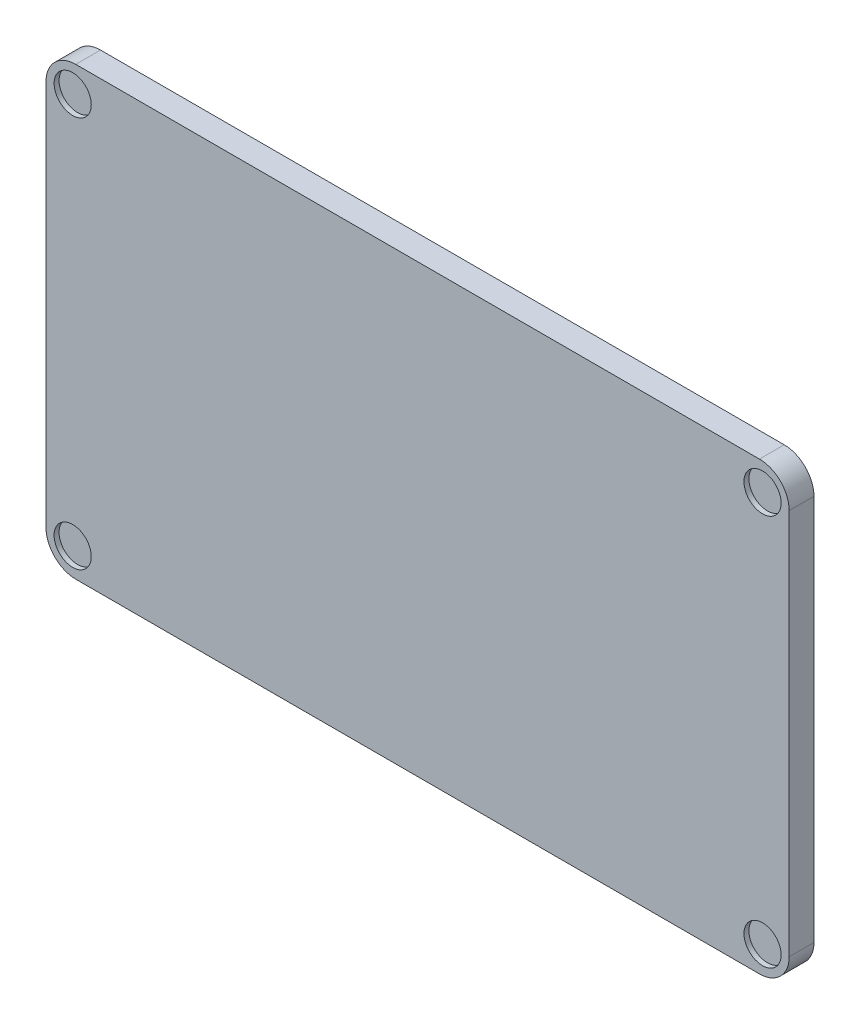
ISO-10303-21;
HEADER;
FILE_DESCRIPTION(('STEP AP214'),'2;1');
FILE_NAME('part.step','',(''),(''),'','','');
FILE_SCHEMA(('AUTOMOTIVE_DESIGN { 1 0 10303 214 1 1 1 1 }'));
ENDSEC;
DATA;
#1=APPLICATION_CONTEXT('core data for automotive mechanical design processes');
#2=APPLICATION_PROTOCOL_DEFINITION('international standard','automotive_design',2000,#1);
#3=PRODUCT_CONTEXT('',#1,'mechanical');
#4=PRODUCT('Part','Part','',(#3));
#5=PRODUCT_RELATED_PRODUCT_CATEGORY('part','',(#4));
#6=PRODUCT_DEFINITION_FORMATION('','',#4);
#7=PRODUCT_DEFINITION_CONTEXT('part definition',#1,'design');
#8=PRODUCT_DEFINITION('design','',#6,#7);
#9=PRODUCT_DEFINITION_SHAPE('','',#8);
#10=(LENGTH_UNIT() NAMED_UNIT(*) SI_UNIT(.MILLI.,.METRE.));
#11=(NAMED_UNIT(*) PLANE_ANGLE_UNIT() SI_UNIT($,.RADIAN.));
#12=(NAMED_UNIT(*) SI_UNIT($,.STERADIAN.) SOLID_ANGLE_UNIT());
#13=UNCERTAINTY_MEASURE_WITH_UNIT(LENGTH_MEASURE(1.E-05),#10,'distance_accuracy_value','');
#14=(GEOMETRIC_REPRESENTATION_CONTEXT(3) GLOBAL_UNCERTAINTY_ASSIGNED_CONTEXT((#13)) GLOBAL_UNIT_ASSIGNED_CONTEXT((#10,
#11,#12)) REPRESENTATION_CONTEXT('',''));
#15=CARTESIAN_POINT('',(0.,0.,0.));
#16=DIRECTION('',(0.,0.,1.));
#17=DIRECTION('',(1.,0.,0.));
#18=AXIS2_PLACEMENT_3D('',#15,#16,#17);
#19=CARTESIAN_POINT('',(-69.,-39.,5.));
#20=DIRECTION('',(0.,0.,-1.));
#21=DIRECTION('',(-1.,0.,0.));
#22=AXIS2_PLACEMENT_3D('',#19,#20,#21);
#23=CYLINDRICAL_SURFACE('',#22,6.00000000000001);
#24=CARTESIAN_POINT('',(-69.,-39.,0.));
#25=DIRECTION('',(0.,0.,1.));
#26=DIRECTION('',(1.,0.,0.));
#27=AXIS2_PLACEMENT_3D('',#24,#25,#26);
#28=CIRCLE('',#27,6.00000000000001);
#29=CARTESIAN_POINT('',(-75.,-39.,0.));
#30=VERTEX_POINT('',#29);
#31=CARTESIAN_POINT('',(-69.,-45.,0.));
#32=VERTEX_POINT('',#31);
#33=EDGE_CURVE('E146',#30,#32,#28,.T.);
#34=ORIENTED_EDGE('',*,*,#33,.T.);
#35=DIRECTION('',(0.,0.,-1.));
#36=VECTOR('',#35,1.);
#37=CARTESIAN_POINT('',(-69.,-45.,5.));
#38=LINE('',#37,#36);
#39=CARTESIAN_POINT('',(-69.,-45.,5.));
#40=VERTEX_POINT('',#39);
#41=EDGE_CURVE('E11',#40,#32,#38,.T.);
#42=ORIENTED_EDGE('',*,*,#41,.F.);
#43=CARTESIAN_POINT('',(-69.,-39.,5.));
#44=DIRECTION('',(0.,0.,1.));
#45=DIRECTION('',(1.,0.,0.));
#46=AXIS2_PLACEMENT_3D('',#43,#44,#45);
#47=CIRCLE('',#46,6.00000000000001);
#48=CARTESIAN_POINT('',(-75.,-39.,5.));
#49=VERTEX_POINT('',#48);
#50=EDGE_CURVE('E169',#49,#40,#47,.T.);
#51=ORIENTED_EDGE('',*,*,#50,.F.);
#52=DIRECTION('',(0.,0.,-1.));
#53=VECTOR('',#52,1.);
#54=CARTESIAN_POINT('',(-75.,-39.,5.));
#55=LINE('',#54,#53);
#56=EDGE_CURVE('E142',#49,#30,#55,.T.);
#57=ORIENTED_EDGE('',*,*,#56,.T.);
#58=EDGE_LOOP('',(#34,#42,#51,#57));
#59=FACE_BOUND('',#58,.T.);
#60=ADVANCED_FACE('F45',(#59),#23,.T.);
#61=CARTESIAN_POINT('',(69.,-45.,5.));
#62=DIRECTION('',(0.,1.,0.));
#63=DIRECTION('',(-1.,0.,0.));
#64=AXIS2_PLACEMENT_3D('',#61,#62,#63);
#65=PLANE('',#64);
#66=DIRECTION('',(1.,0.,0.));
#67=VECTOR('',#66,1.);
#68=CARTESIAN_POINT('',(69.,-45.,0.));
#69=LINE('',#68,#67);
#70=CARTESIAN_POINT('',(69.,-45.,0.));
#71=VERTEX_POINT('',#70);
#72=EDGE_CURVE('E150',#32,#71,#69,.T.);
#73=ORIENTED_EDGE('',*,*,#72,.T.);
#74=DIRECTION('',(0.,0.,-1.));
#75=VECTOR('',#74,1.);
#76=CARTESIAN_POINT('',(69.,-45.,5.));
#77=LINE('',#76,#75);
#78=CARTESIAN_POINT('',(69.,-45.,5.));
#79=VERTEX_POINT('',#78);
#80=EDGE_CURVE('E54',#79,#71,#77,.T.);
#81=ORIENTED_EDGE('',*,*,#80,.F.);
#82=DIRECTION('',(1.,0.,0.));
#83=VECTOR('',#82,1.);
#84=CARTESIAN_POINT('',(69.,-45.,5.));
#85=LINE('',#84,#83);
#86=EDGE_CURVE('E105',#40,#79,#85,.T.);
#87=ORIENTED_EDGE('',*,*,#86,.F.);
#88=ORIENTED_EDGE('',*,*,#41,.T.);
#89=EDGE_LOOP('',(#73,#81,#87,#88));
#90=FACE_BOUND('',#89,.T.);
#91=ADVANCED_FACE('F268',(#90),#65,.F.);
#92=CARTESIAN_POINT('',(69.,-39.,5.));
#93=DIRECTION('',(0.,0.,-1.));
#94=DIRECTION('',(-1.,0.,0.));
#95=AXIS2_PLACEMENT_3D('',#92,#93,#94);
#96=CYLINDRICAL_SURFACE('',#95,6.);
#97=CARTESIAN_POINT('',(69.,-39.,0.));
#98=DIRECTION('',(0.,0.,1.));
#99=DIRECTION('',(1.,0.,0.));
#100=AXIS2_PLACEMENT_3D('',#97,#98,#99);
#101=CIRCLE('',#100,6.);
#102=CARTESIAN_POINT('',(75.,-39.,0.));
#103=VERTEX_POINT('',#102);
#104=EDGE_CURVE('E154',#71,#103,#101,.T.);
#105=ORIENTED_EDGE('',*,*,#104,.T.);
#106=DIRECTION('',(0.,0.,-1.));
#107=VECTOR('',#106,1.);
#108=CARTESIAN_POINT('',(75.,-39.,5.));
#109=LINE('',#108,#107);
#110=CARTESIAN_POINT('',(75.,-39.,5.));
#111=VERTEX_POINT('',#110);
#112=EDGE_CURVE('E180',#111,#103,#109,.T.);
#113=ORIENTED_EDGE('',*,*,#112,.F.);
#114=CARTESIAN_POINT('',(69.,-39.,5.));
#115=DIRECTION('',(0.,0.,1.));
#116=DIRECTION('',(1.,0.,0.));
#117=AXIS2_PLACEMENT_3D('',#114,#115,#116);
#118=CIRCLE('',#117,6.);
#119=EDGE_CURVE('E190',#79,#111,#118,.T.);
#120=ORIENTED_EDGE('',*,*,#119,.F.);
#121=ORIENTED_EDGE('',*,*,#80,.T.);
#122=EDGE_LOOP('',(#105,#113,#120,#121));
#123=FACE_BOUND('',#122,.T.);
#124=ADVANCED_FACE('F188',(#123),#96,.T.);
#125=CARTESIAN_POINT('',(75.,-39.,5.));
#126=DIRECTION('',(-1.,0.,0.));
#127=DIRECTION('',(0.,0.,1.));
#128=AXIS2_PLACEMENT_3D('',#125,#126,#127);
#129=PLANE('',#128);
#130=DIRECTION('',(0.,1.,0.));
#131=VECTOR('',#130,1.);
#132=CARTESIAN_POINT('',(75.,-39.,0.));
#133=LINE('',#132,#131);
#134=CARTESIAN_POINT('',(75.,39.,0.));
#135=VERTEX_POINT('',#134);
#136=EDGE_CURVE('E157',#103,#135,#133,.T.);
#137=ORIENTED_EDGE('',*,*,#136,.T.);
#138=DIRECTION('',(0.,0.,-1.));
#139=VECTOR('',#138,1.);
#140=CARTESIAN_POINT('',(75.,39.,5.));
#141=LINE('',#140,#139);
#142=CARTESIAN_POINT('',(75.,39.,5.));
#143=VERTEX_POINT('',#142);
#144=EDGE_CURVE('E176',#143,#135,#141,.T.);
#145=ORIENTED_EDGE('',*,*,#144,.F.);
#146=DIRECTION('',(0.,1.,0.));
#147=VECTOR('',#146,1.);
#148=CARTESIAN_POINT('',(75.,-39.,5.));
#149=LINE('',#148,#147);
#150=EDGE_CURVE('E203',#111,#143,#149,.T.);
#151=ORIENTED_EDGE('',*,*,#150,.F.);
#152=ORIENTED_EDGE('',*,*,#112,.T.);
#153=EDGE_LOOP('',(#137,#145,#151,#152));
#154=FACE_BOUND('',#153,.T.);
#155=ADVANCED_FACE('F198',(#154),#129,.F.);
#156=CARTESIAN_POINT('',(69.,39.,5.));
#157=DIRECTION('',(0.,0.,-1.));
#158=DIRECTION('',(-1.,0.,0.));
#159=AXIS2_PLACEMENT_3D('',#156,#157,#158);
#160=CYLINDRICAL_SURFACE('',#159,6.00000000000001);
#161=CARTESIAN_POINT('',(69.,39.,0.));
#162=DIRECTION('',(0.,0.,1.));
#163=DIRECTION('',(-1.,0.,0.));
#164=AXIS2_PLACEMENT_3D('',#161,#162,#163);
#165=CIRCLE('',#164,6.00000000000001);
#166=CARTESIAN_POINT('',(69.,45.,0.));
#167=VERTEX_POINT('',#166);
#168=EDGE_CURVE('E160',#135,#167,#165,.T.);
#169=ORIENTED_EDGE('',*,*,#168,.T.);
#170=DIRECTION('',(0.,0.,-1.));
#171=VECTOR('',#170,1.);
#172=CARTESIAN_POINT('',(69.,45.,5.));
#173=LINE('',#172,#171);
#174=CARTESIAN_POINT('',(69.,45.,5.));
#175=VERTEX_POINT('',#174);
#176=EDGE_CURVE('E135',#175,#167,#173,.T.);
#177=ORIENTED_EDGE('',*,*,#176,.F.);
#178=CARTESIAN_POINT('',(69.,39.,5.));
#179=DIRECTION('',(0.,0.,1.));
#180=DIRECTION('',(-1.,0.,0.));
#181=AXIS2_PLACEMENT_3D('',#178,#179,#180);
#182=CIRCLE('',#181,6.00000000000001);
#183=EDGE_CURVE('E124',#143,#175,#182,.T.);
#184=ORIENTED_EDGE('',*,*,#183,.F.);
#185=ORIENTED_EDGE('',*,*,#144,.T.);
#186=EDGE_LOOP('',(#169,#177,#184,#185));
#187=FACE_BOUND('',#186,.T.);
#188=ADVANCED_FACE('F201',(#187),#160,.T.);
#189=CARTESIAN_POINT('',(69.,45.,5.));
#190=DIRECTION('',(0.,-1.,0.));
#191=DIRECTION('',(1.,0.,0.));
#192=AXIS2_PLACEMENT_3D('',#189,#190,#191);
#193=PLANE('',#192);
#194=DIRECTION('',(-1.,0.,0.));
#195=VECTOR('',#194,1.);
#196=CARTESIAN_POINT('',(69.,45.,0.));
#197=LINE('',#196,#195);
#198=CARTESIAN_POINT('',(-69.,45.,0.));
#199=VERTEX_POINT('',#198);
#200=EDGE_CURVE('E133',#167,#199,#197,.T.);
#201=ORIENTED_EDGE('',*,*,#200,.T.);
#202=DIRECTION('',(0.,0.,-1.));
#203=VECTOR('',#202,1.);
#204=CARTESIAN_POINT('',(-69.,45.,5.));
#205=LINE('',#204,#203);
#206=CARTESIAN_POINT('',(-69.,45.,5.));
#207=VERTEX_POINT('',#206);
#208=EDGE_CURVE('E130',#207,#199,#205,.T.);
#209=ORIENTED_EDGE('',*,*,#208,.F.);
#210=DIRECTION('',(-1.,0.,0.));
#211=VECTOR('',#210,1.);
#212=CARTESIAN_POINT('',(69.,45.,5.));
#213=LINE('',#212,#211);
#214=EDGE_CURVE('E118',#175,#207,#213,.T.);
#215=ORIENTED_EDGE('',*,*,#214,.F.);
#216=ORIENTED_EDGE('',*,*,#176,.T.);
#217=EDGE_LOOP('',(#201,#209,#215,#216));
#218=FACE_BOUND('',#217,.T.);
#219=ADVANCED_FACE('F131',(#218),#193,.F.);
#220=CARTESIAN_POINT('',(-69.,39.,5.));
#221=DIRECTION('',(0.,0.,-1.));
#222=DIRECTION('',(-1.,0.,0.));
#223=AXIS2_PLACEMENT_3D('',#220,#221,#222);
#224=CYLINDRICAL_SURFACE('',#223,6.00000000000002);
#225=CARTESIAN_POINT('',(-69.,39.,0.));
#226=DIRECTION('',(0.,0.,1.));
#227=DIRECTION('',(-1.,0.,0.));
#228=AXIS2_PLACEMENT_3D('',#225,#226,#227);
#229=CIRCLE('',#228,6.00000000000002);
#230=CARTESIAN_POINT('',(-75.,39.,0.));
#231=VERTEX_POINT('',#230);
#232=EDGE_CURVE('E91',#199,#231,#229,.T.);
#233=ORIENTED_EDGE('',*,*,#232,.T.);
#234=DIRECTION('',(0.,0.,-1.));
#235=VECTOR('',#234,1.);
#236=CARTESIAN_POINT('',(-75.,39.,5.));
#237=LINE('',#236,#235);
#238=CARTESIAN_POINT('',(-75.,39.,5.));
#239=VERTEX_POINT('',#238);
#240=EDGE_CURVE('E136',#239,#231,#237,.T.);
#241=ORIENTED_EDGE('',*,*,#240,.F.);
#242=CARTESIAN_POINT('',(-69.,39.,5.));
#243=DIRECTION('',(0.,0.,1.));
#244=DIRECTION('',(-1.,0.,0.));
#245=AXIS2_PLACEMENT_3D('',#242,#243,#244);
#246=CIRCLE('',#245,6.00000000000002);
#247=EDGE_CURVE('E122',#207,#239,#246,.T.);
#248=ORIENTED_EDGE('',*,*,#247,.F.);
#249=ORIENTED_EDGE('',*,*,#208,.T.);
#250=EDGE_LOOP('',(#233,#241,#248,#249));
#251=FACE_BOUND('',#250,.T.);
#252=ADVANCED_FACE('F138',(#251),#224,.T.);
#253=CARTESIAN_POINT('',(-75.,-39.,5.));
#254=DIRECTION('',(1.,0.,0.));
#255=DIRECTION('',(0.,0.,-1.));
#256=AXIS2_PLACEMENT_3D('',#253,#254,#255);
#257=PLANE('',#256);
#258=DIRECTION('',(0.,-1.,0.));
#259=VECTOR('',#258,1.);
#260=CARTESIAN_POINT('',(-75.,-39.,0.));
#261=LINE('',#260,#259);
#262=EDGE_CURVE('E97',#231,#30,#261,.T.);
#263=ORIENTED_EDGE('',*,*,#262,.T.);
#264=ORIENTED_EDGE('',*,*,#56,.F.);
#265=DIRECTION('',(0.,-1.,0.));
#266=VECTOR('',#265,1.);
#267=CARTESIAN_POINT('',(-75.,-39.,5.));
#268=LINE('',#267,#266);
#269=EDGE_CURVE('E62',#239,#49,#268,.T.);
#270=ORIENTED_EDGE('',*,*,#269,.F.);
#271=ORIENTED_EDGE('',*,*,#240,.T.);
#272=EDGE_LOOP('',(#263,#264,#270,#271));
#273=FACE_BOUND('',#272,.T.);
#274=ADVANCED_FACE('F249',(#273),#257,.F.);
#275=CARTESIAN_POINT('',(-69.,-39.,5.));
#276=DIRECTION('',(0.,0.,1.));
#277=DIRECTION('',(1.,0.,0.));
#278=AXIS2_PLACEMENT_3D('',#275,#276,#277);
#279=PLANE('',#278);
#280=CARTESIAN_POINT('',(-69.6196053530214,-39.4937628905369,5.));
#281=DIRECTION('',(0.,0.,1.));
#282=DIRECTION('',(-1.,0.,0.));
#283=AXIS2_PLACEMENT_3D('',#280,#281,#282);
#284=CIRCLE('',#283,3.75000000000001);
#285=CARTESIAN_POINT('',(-73.3696053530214,-39.4937628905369,5.));
#286=VERTEX_POINT('',#285);
#287=EDGE_CURVE('E225',#286,#286,#284,.T.);
#288=ORIENTED_EDGE('',*,*,#287,.F.);
#289=EDGE_LOOP('',(#288));
#290=FACE_BOUND('',#289,.T.);
#291=CARTESIAN_POINT('',(69.6196053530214,-39.4937628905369,5.));
#292=DIRECTION('',(0.,0.,1.));
#293=DIRECTION('',(1.,0.,0.));
#294=AXIS2_PLACEMENT_3D('',#291,#292,#293);
#295=CIRCLE('',#294,3.75000000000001);
#296=CARTESIAN_POINT('',(73.3696053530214,-39.4937628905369,5.));
#297=VERTEX_POINT('',#296);
#298=EDGE_CURVE('E233',#297,#297,#295,.T.);
#299=ORIENTED_EDGE('',*,*,#298,.F.);
#300=EDGE_LOOP('',(#299));
#301=FACE_BOUND('',#300,.T.);
#302=CARTESIAN_POINT('',(69.6196053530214,39.4937628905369,5.));
#303=DIRECTION('',(0.,0.,1.));
#304=DIRECTION('',(-1.,0.,0.));
#305=AXIS2_PLACEMENT_3D('',#302,#303,#304);
#306=CIRCLE('',#305,3.75000000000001);
#307=CARTESIAN_POINT('',(65.8696053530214,39.4937628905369,5.));
#308=VERTEX_POINT('',#307);
#309=EDGE_CURVE('E217',#308,#308,#306,.T.);
#310=ORIENTED_EDGE('',*,*,#309,.F.);
#311=EDGE_LOOP('',(#310));
#312=FACE_BOUND('',#311,.T.);
#313=CARTESIAN_POINT('',(-69.6196053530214,39.4937628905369,5.));
#314=DIRECTION('',(0.,0.,1.));
#315=DIRECTION('',(1.,0.,0.));
#316=AXIS2_PLACEMENT_3D('',#313,#314,#315);
#317=CIRCLE('',#316,3.75000000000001);
#318=CARTESIAN_POINT('',(-65.8696053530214,39.4937628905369,5.));
#319=VERTEX_POINT('',#318);
#320=EDGE_CURVE('E213',#319,#319,#317,.T.);
#321=ORIENTED_EDGE('',*,*,#320,.F.);
#322=EDGE_LOOP('',(#321));
#323=FACE_BOUND('',#322,.T.);
#324=ORIENTED_EDGE('',*,*,#50,.T.);
#325=ORIENTED_EDGE('',*,*,#86,.T.);
#326=ORIENTED_EDGE('',*,*,#119,.T.);
#327=ORIENTED_EDGE('',*,*,#150,.T.);
#328=ORIENTED_EDGE('',*,*,#183,.T.);
#329=ORIENTED_EDGE('',*,*,#214,.T.);
#330=ORIENTED_EDGE('',*,*,#247,.T.);
#331=ORIENTED_EDGE('',*,*,#269,.T.);
#332=EDGE_LOOP('',(#324,#325,#326,#327,#328,#329,#330,#331));
#333=FACE_BOUND('',#332,.T.);
#334=ADVANCED_FACE('F120',(#290,#301,#312,#323,#333),#279,.T.);
#335=CARTESIAN_POINT('',(-69.,-39.,0.));
#336=DIRECTION('',(0.,0.,1.));
#337=DIRECTION('',(1.,0.,0.));
#338=AXIS2_PLACEMENT_3D('',#335,#336,#337);
#339=PLANE('',#338);
#340=ORIENTED_EDGE('',*,*,#33,.F.);
#341=ORIENTED_EDGE('',*,*,#262,.F.);
#342=ORIENTED_EDGE('',*,*,#232,.F.);
#343=ORIENTED_EDGE('',*,*,#200,.F.);
#344=ORIENTED_EDGE('',*,*,#168,.F.);
#345=ORIENTED_EDGE('',*,*,#136,.F.);
#346=ORIENTED_EDGE('',*,*,#104,.F.);
#347=ORIENTED_EDGE('',*,*,#72,.F.);
#348=EDGE_LOOP('',(#340,#341,#342,#343,#344,#345,#346,#347));
#349=FACE_BOUND('',#348,.T.);
#350=ADVANCED_FACE('F194',(#349),#339,.F.);
#351=CARTESIAN_POINT('',(-69.6196053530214,39.4937628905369,4.));
#352=DIRECTION('',(0.,0.,1.));
#353=DIRECTION('',(1.,0.,0.));
#354=AXIS2_PLACEMENT_3D('',#351,#352,#353);
#355=CYLINDRICAL_SURFACE('',#354,3.75000000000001);
#356=CARTESIAN_POINT('',(-69.6196053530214,39.4937628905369,4.));
#357=DIRECTION('',(0.,0.,1.));
#358=DIRECTION('',(1.,0.,0.));
#359=AXIS2_PLACEMENT_3D('',#356,#357,#358);
#360=CIRCLE('',#359,3.75000000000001);
#361=CARTESIAN_POINT('',(-65.8696053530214,39.4937628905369,4.));
#362=VERTEX_POINT('',#361);
#363=EDGE_CURVE('E151',#362,#362,#360,.T.);
#364=ORIENTED_EDGE('',*,*,#363,.F.);
#365=EDGE_LOOP('',(#364));
#366=FACE_BOUND('',#365,.T.);
#367=ORIENTED_EDGE('',*,*,#320,.T.);
#368=EDGE_LOOP('',(#367));
#369=FACE_BOUND('',#368,.T.);
#370=ADVANCED_FACE('F254',(#366,#369),#355,.F.);
#371=CARTESIAN_POINT('',(-69.6196053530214,39.4937628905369,4.));
#372=DIRECTION('',(0.,0.,1.));
#373=DIRECTION('',(1.,0.,0.));
#374=AXIS2_PLACEMENT_3D('',#371,#372,#373);
#375=PLANE('',#374);
#376=ORIENTED_EDGE('',*,*,#363,.T.);
#377=EDGE_LOOP('',(#376));
#378=FACE_BOUND('',#377,.T.);
#379=ADVANCED_FACE('F256',(#378),#375,.T.);
#380=CARTESIAN_POINT('',(69.6196053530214,39.4937628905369,4.));
#381=DIRECTION('',(0.,0.,1.));
#382=DIRECTION('',(1.,0.,0.));
#383=AXIS2_PLACEMENT_3D('',#380,#381,#382);
#384=CYLINDRICAL_SURFACE('',#383,3.75000000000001);
#385=CARTESIAN_POINT('',(69.6196053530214,39.4937628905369,4.));
#386=DIRECTION('',(0.,0.,1.));
#387=DIRECTION('',(-1.,0.,0.));
#388=AXIS2_PLACEMENT_3D('',#385,#386,#387);
#389=CIRCLE('',#388,3.75000000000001);
#390=CARTESIAN_POINT('',(65.8696053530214,39.4937628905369,4.));
#391=VERTEX_POINT('',#390);
#392=EDGE_CURVE('E237',#391,#391,#389,.T.);
#393=ORIENTED_EDGE('',*,*,#392,.F.);
#394=EDGE_LOOP('',(#393));
#395=FACE_BOUND('',#394,.T.);
#396=ORIENTED_EDGE('',*,*,#309,.T.);
#397=EDGE_LOOP('',(#396));
#398=FACE_BOUND('',#397,.T.);
#399=ADVANCED_FACE('F245',(#395,#398),#384,.F.);
#400=CARTESIAN_POINT('',(69.6196053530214,39.4937628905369,4.));
#401=DIRECTION('',(0.,0.,-1.));
#402=DIRECTION('',(-1.,0.,0.));
#403=AXIS2_PLACEMENT_3D('',#400,#401,#402);
#404=PLANE('',#403);
#405=ORIENTED_EDGE('',*,*,#392,.T.);
#406=EDGE_LOOP('',(#405));
#407=FACE_BOUND('',#406,.T.);
#408=ADVANCED_FACE('F349',(#407),#404,.F.);
#409=CARTESIAN_POINT('',(69.6196053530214,-39.4937628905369,4.));
#410=DIRECTION('',(0.,0.,1.));
#411=DIRECTION('',(1.,0.,0.));
#412=AXIS2_PLACEMENT_3D('',#409,#410,#411);
#413=CYLINDRICAL_SURFACE('',#412,3.75000000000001);
#414=CARTESIAN_POINT('',(69.6196053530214,-39.4937628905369,4.));
#415=DIRECTION('',(0.,0.,1.));
#416=DIRECTION('',(1.,0.,0.));
#417=AXIS2_PLACEMENT_3D('',#414,#415,#416);
#418=CIRCLE('',#417,3.75000000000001);
#419=CARTESIAN_POINT('',(73.3696053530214,-39.4937628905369,4.));
#420=VERTEX_POINT('',#419);
#421=EDGE_CURVE('E229',#420,#420,#418,.T.);
#422=ORIENTED_EDGE('',*,*,#421,.F.);
#423=EDGE_LOOP('',(#422));
#424=FACE_BOUND('',#423,.T.);
#425=ORIENTED_EDGE('',*,*,#298,.T.);
#426=EDGE_LOOP('',(#425));
#427=FACE_BOUND('',#426,.T.);
#428=ADVANCED_FACE('F359',(#424,#427),#413,.F.);
#429=CARTESIAN_POINT('',(69.6196053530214,-39.4937628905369,4.));
#430=DIRECTION('',(0.,0.,1.));
#431=DIRECTION('',(1.,0.,0.));
#432=AXIS2_PLACEMENT_3D('',#429,#430,#431);
#433=PLANE('',#432);
#434=ORIENTED_EDGE('',*,*,#421,.T.);
#435=EDGE_LOOP('',(#434));
#436=FACE_BOUND('',#435,.T.);
#437=ADVANCED_FACE('F369',(#436),#433,.T.);
#438=CARTESIAN_POINT('',(-69.6196053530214,-39.4937628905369,4.));
#439=DIRECTION('',(0.,0.,1.));
#440=DIRECTION('',(1.,0.,0.));
#441=AXIS2_PLACEMENT_3D('',#438,#439,#440);
#442=CYLINDRICAL_SURFACE('',#441,3.75000000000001);
#443=CARTESIAN_POINT('',(-69.6196053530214,-39.4937628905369,4.));
#444=DIRECTION('',(0.,0.,1.));
#445=DIRECTION('',(-1.,0.,0.));
#446=AXIS2_PLACEMENT_3D('',#443,#444,#445);
#447=CIRCLE('',#446,3.75000000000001);
#448=CARTESIAN_POINT('',(-73.3696053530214,-39.4937628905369,4.));
#449=VERTEX_POINT('',#448);
#450=EDGE_CURVE('E221',#449,#449,#447,.T.);
#451=ORIENTED_EDGE('',*,*,#450,.F.);
#452=EDGE_LOOP('',(#451));
#453=FACE_BOUND('',#452,.T.);
#454=ORIENTED_EDGE('',*,*,#287,.T.);
#455=EDGE_LOOP('',(#454));
#456=FACE_BOUND('',#455,.T.);
#457=ADVANCED_FACE('F379',(#453,#456),#442,.F.);
#458=CARTESIAN_POINT('',(-69.6196053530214,-39.4937628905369,4.));
#459=DIRECTION('',(0.,0.,-1.));
#460=DIRECTION('',(-1.,0.,0.));
#461=AXIS2_PLACEMENT_3D('',#458,#459,#460);
#462=PLANE('',#461);
#463=ORIENTED_EDGE('',*,*,#450,.T.);
#464=EDGE_LOOP('',(#463));
#465=FACE_BOUND('',#464,.T.);
#466=ADVANCED_FACE('F389',(#465),#462,.F.);
#467=CLOSED_SHELL('',(#60,#91,#124,#155,#188,#219,#252,#274,#334,#350,#370,#379,#399,#408,#428,
#437,#457,#466));
#468=MANIFOLD_SOLID_BREP('B2',#467);
#469=ADVANCED_BREP_SHAPE_REPRESENTATION('',(#18,#468),#14);
#470=SHAPE_DEFINITION_REPRESENTATION(#9,#469);
ENDSEC;
END-ISO-10303-21;
